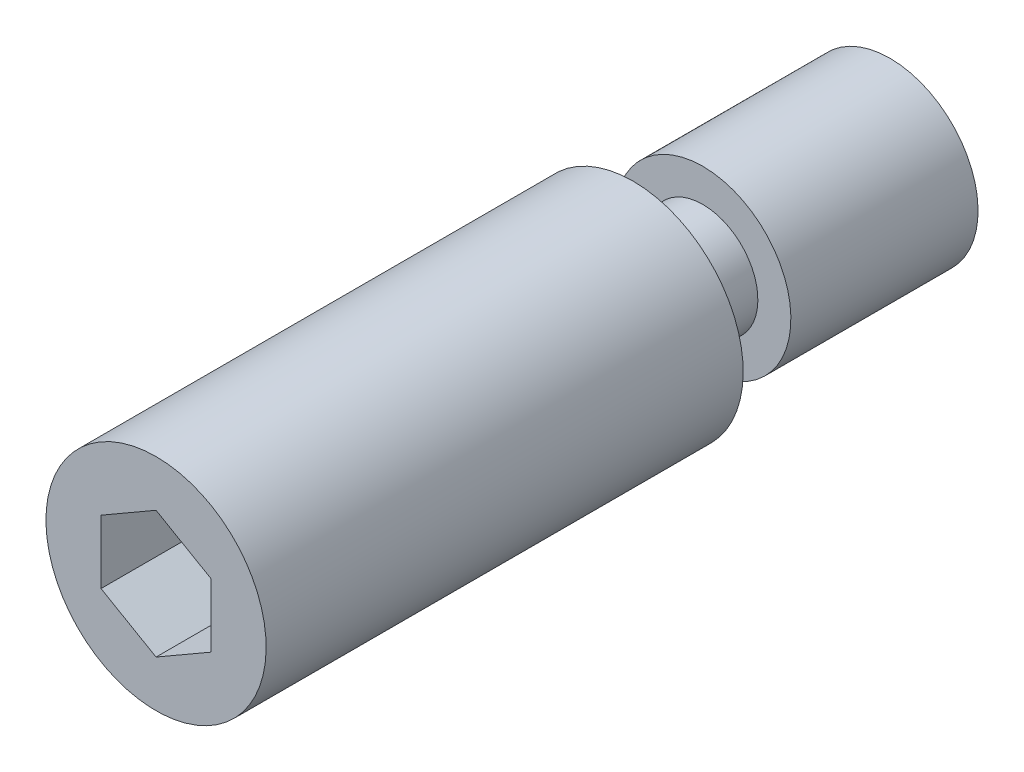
ISO-10303-21;
HEADER;
FILE_DESCRIPTION(('STEP AP214'),'2;1');
FILE_NAME('part.step','',(''),(''),'','','');
FILE_SCHEMA(('AUTOMOTIVE_DESIGN { 1 0 10303 214 1 1 1 1 }'));
ENDSEC;
DATA;
#1=APPLICATION_CONTEXT('core data for automotive mechanical design processes');
#2=APPLICATION_PROTOCOL_DEFINITION('international standard','automotive_design',2000,#1);
#3=PRODUCT_CONTEXT('',#1,'mechanical');
#4=PRODUCT('Part','Part','',(#3));
#5=PRODUCT_RELATED_PRODUCT_CATEGORY('part','',(#4));
#6=PRODUCT_DEFINITION_FORMATION('','',#4);
#7=PRODUCT_DEFINITION_CONTEXT('part definition',#1,'design');
#8=PRODUCT_DEFINITION('design','',#6,#7);
#9=PRODUCT_DEFINITION_SHAPE('','',#8);
#10=(LENGTH_UNIT() NAMED_UNIT(*) SI_UNIT(.MILLI.,.METRE.));
#11=(NAMED_UNIT(*) PLANE_ANGLE_UNIT() SI_UNIT($,.RADIAN.));
#12=(NAMED_UNIT(*) SI_UNIT($,.STERADIAN.) SOLID_ANGLE_UNIT());
#13=UNCERTAINTY_MEASURE_WITH_UNIT(LENGTH_MEASURE(1.E-05),#10,'distance_accuracy_value','');
#14=(GEOMETRIC_REPRESENTATION_CONTEXT(3) GLOBAL_UNCERTAINTY_ASSIGNED_CONTEXT((#13)) GLOBAL_UNIT_ASSIGNED_CONTEXT((#10,
#11,#12)) REPRESENTATION_CONTEXT('',''));
#15=CARTESIAN_POINT('',(0.,0.,0.));
#16=DIRECTION('',(0.,0.,1.));
#17=DIRECTION('',(1.,0.,0.));
#18=AXIS2_PLACEMENT_3D('',#15,#16,#17);
#19=CARTESIAN_POINT('',(0.,-3.,7.));
#20=DIRECTION('',(0.,0.,-1.));
#21=DIRECTION('',(0.,-1.,0.));
#22=AXIS2_PLACEMENT_3D('',#19,#20,#21);
#23=PLANE('',#22);
#24=CARTESIAN_POINT('',(0.,0.,7.));
#25=DIRECTION('',(0.,0.,1.));
#26=DIRECTION('',(0.,1.,0.));
#27=AXIS2_PLACEMENT_3D('',#24,#25,#26);
#28=CIRCLE('',#27,1.5);
#29=CARTESIAN_POINT('',(0.,1.5,7.));
#30=VERTEX_POINT('',#29);
#31=EDGE_CURVE('E115',#30,#30,#28,.T.);
#32=ORIENTED_EDGE('',*,*,#31,.T.);
#33=EDGE_LOOP('',(#32));
#34=FACE_BOUND('',#33,.T.);
#35=CARTESIAN_POINT('',(0.,0.,7.));
#36=DIRECTION('',(0.,0.,1.));
#37=DIRECTION('',(0.,1.,0.));
#38=AXIS2_PLACEMENT_3D('',#35,#36,#37);
#39=CIRCLE('',#38,3.);
#40=CARTESIAN_POINT('',(0.,3.,7.));
#41=VERTEX_POINT('',#40);
#42=EDGE_CURVE('E9',#41,#41,#39,.T.);
#43=ORIENTED_EDGE('',*,*,#42,.F.);
#44=EDGE_LOOP('',(#43));
#45=FACE_BOUND('',#44,.T.);
#46=ADVANCED_FACE('F14',(#34,#45),#23,.T.);
#47=CARTESIAN_POINT('',(0.,0.,20.));
#48=DIRECTION('',(0.,0.,1.));
#49=DIRECTION('',(0.,1.,0.));
#50=AXIS2_PLACEMENT_3D('',#47,#48,#49);
#51=CYLINDRICAL_SURFACE('',#50,3.);
#52=CARTESIAN_POINT('',(0.,0.,20.));
#53=DIRECTION('',(0.,0.,1.));
#54=DIRECTION('',(0.,1.,0.));
#55=AXIS2_PLACEMENT_3D('',#52,#53,#54);
#56=CIRCLE('',#55,3.);
#57=CARTESIAN_POINT('',(0.,3.,20.));
#58=VERTEX_POINT('',#57);
#59=EDGE_CURVE('E21',#58,#58,#56,.T.);
#60=ORIENTED_EDGE('',*,*,#59,.F.);
#61=EDGE_LOOP('',(#60));
#62=FACE_BOUND('',#61,.T.);
#63=ORIENTED_EDGE('',*,*,#42,.T.);
#64=EDGE_LOOP('',(#63));
#65=FACE_BOUND('',#64,.T.);
#66=ADVANCED_FACE('F136',(#62,#65),#51,.T.);
#67=CARTESIAN_POINT('',(0.,-3.,20.));
#68=DIRECTION('',(0.,0.,-1.));
#69=DIRECTION('',(0.,-1.,0.));
#70=AXIS2_PLACEMENT_3D('',#67,#68,#69);
#71=PLANE('',#70);
#72=DIRECTION('',(-0.866025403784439,-0.5,0.));
#73=VECTOR('',#72,1.);
#74=CARTESIAN_POINT('',(0.,1.73205080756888,20.));
#75=LINE('',#74,#73);
#76=CARTESIAN_POINT('',(0.,1.73205080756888,20.));
#77=VERTEX_POINT('',#76);
#78=CARTESIAN_POINT('',(-1.5,0.866025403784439,20.));
#79=VERTEX_POINT('',#78);
#80=EDGE_CURVE('E102',#77,#79,#75,.T.);
#81=ORIENTED_EDGE('',*,*,#80,.F.);
#82=DIRECTION('',(-0.866025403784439,0.5,0.));
#83=VECTOR('',#82,1.);
#84=CARTESIAN_POINT('',(1.5,0.866025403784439,20.));
#85=LINE('',#84,#83);
#86=CARTESIAN_POINT('',(1.5,0.866025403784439,20.));
#87=VERTEX_POINT('',#86);
#88=EDGE_CURVE('E28',#87,#77,#85,.T.);
#89=ORIENTED_EDGE('',*,*,#88,.F.);
#90=DIRECTION('',(0.,1.,0.));
#91=VECTOR('',#90,1.);
#92=CARTESIAN_POINT('',(1.5,-0.866025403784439,20.));
#93=LINE('',#92,#91);
#94=CARTESIAN_POINT('',(1.5,-0.866025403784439,20.));
#95=VERTEX_POINT('',#94);
#96=EDGE_CURVE('E111',#95,#87,#93,.T.);
#97=ORIENTED_EDGE('',*,*,#96,.F.);
#98=DIRECTION('',(0.866025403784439,0.5,0.));
#99=VECTOR('',#98,1.);
#100=CARTESIAN_POINT('',(0.,-1.73205080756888,20.));
#101=LINE('',#100,#99);
#102=CARTESIAN_POINT('',(0.,-1.73205080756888,20.));
#103=VERTEX_POINT('',#102);
#104=EDGE_CURVE('E109',#103,#95,#101,.T.);
#105=ORIENTED_EDGE('',*,*,#104,.F.);
#106=DIRECTION('',(0.866025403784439,-0.5,0.));
#107=VECTOR('',#106,1.);
#108=CARTESIAN_POINT('',(-1.5,-0.866025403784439,20.));
#109=LINE('',#108,#107);
#110=CARTESIAN_POINT('',(-1.5,-0.866025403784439,20.));
#111=VERTEX_POINT('',#110);
#112=EDGE_CURVE('E76',#111,#103,#109,.T.);
#113=ORIENTED_EDGE('',*,*,#112,.F.);
#114=DIRECTION('',(0.,-1.,0.));
#115=VECTOR('',#114,1.);
#116=CARTESIAN_POINT('',(-1.5,0.866025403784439,20.));
#117=LINE('',#116,#115);
#118=EDGE_CURVE('E105',#79,#111,#117,.T.);
#119=ORIENTED_EDGE('',*,*,#118,.F.);
#120=EDGE_LOOP('',(#81,#89,#97,#105,#113,#119));
#121=FACE_BOUND('',#120,.T.);
#122=ORIENTED_EDGE('',*,*,#59,.T.);
#123=EDGE_LOOP('',(#122));
#124=FACE_BOUND('',#123,.T.);
#125=ADVANCED_FACE('F134',(#121,#124),#71,.F.);
#126=CARTESIAN_POINT('',(0.,-2.4,0.));
#127=DIRECTION('',(0.,0.,-1.));
#128=DIRECTION('',(0.,-1.,0.));
#129=AXIS2_PLACEMENT_3D('',#126,#127,#128);
#130=PLANE('',#129);
#131=CARTESIAN_POINT('',(0.,0.,0.));
#132=DIRECTION('',(0.,0.,1.));
#133=DIRECTION('',(0.,1.,0.));
#134=AXIS2_PLACEMENT_3D('',#131,#132,#133);
#135=CIRCLE('',#134,2.4);
#136=CARTESIAN_POINT('',(0.,2.4,0.));
#137=VERTEX_POINT('',#136);
#138=EDGE_CURVE('E129',#137,#137,#135,.T.);
#139=ORIENTED_EDGE('',*,*,#138,.F.);
#140=EDGE_LOOP('',(#139));
#141=FACE_BOUND('',#140,.T.);
#142=ADVANCED_FACE('F167',(#141),#130,.T.);
#143=CARTESIAN_POINT('',(0.,0.,20.));
#144=DIRECTION('',(0.,0.,1.));
#145=DIRECTION('',(0.,1.,0.));
#146=AXIS2_PLACEMENT_3D('',#143,#144,#145);
#147=CYLINDRICAL_SURFACE('',#146,2.4);
#148=ORIENTED_EDGE('',*,*,#138,.T.);
#149=EDGE_LOOP('',(#148));
#150=FACE_BOUND('',#149,.T.);
#151=CARTESIAN_POINT('',(0.,0.,5.1));
#152=DIRECTION('',(0.,0.,1.));
#153=DIRECTION('',(0.,1.,0.));
#154=AXIS2_PLACEMENT_3D('',#151,#152,#153);
#155=CIRCLE('',#154,2.4);
#156=CARTESIAN_POINT('',(0.,2.4,5.1));
#157=VERTEX_POINT('',#156);
#158=EDGE_CURVE('E126',#157,#157,#155,.T.);
#159=ORIENTED_EDGE('',*,*,#158,.F.);
#160=EDGE_LOOP('',(#159));
#161=FACE_BOUND('',#160,.T.);
#162=ADVANCED_FACE('F160',(#150,#161),#147,.T.);
#163=CARTESIAN_POINT('',(0.,-1.5,5.1));
#164=DIRECTION('',(0.,0.,1.));
#165=DIRECTION('',(0.,1.,0.));
#166=AXIS2_PLACEMENT_3D('',#163,#164,#165);
#167=PLANE('',#166);
#168=ORIENTED_EDGE('',*,*,#158,.T.);
#169=EDGE_LOOP('',(#168));
#170=FACE_BOUND('',#169,.T.);
#171=CARTESIAN_POINT('',(0.,0.,5.1));
#172=DIRECTION('',(0.,0.,1.));
#173=DIRECTION('',(0.,1.,0.));
#174=AXIS2_PLACEMENT_3D('',#171,#172,#173);
#175=CIRCLE('',#174,1.5);
#176=CARTESIAN_POINT('',(0.,1.5,5.1));
#177=VERTEX_POINT('',#176);
#178=EDGE_CURVE('E123',#177,#177,#175,.T.);
#179=ORIENTED_EDGE('',*,*,#178,.F.);
#180=EDGE_LOOP('',(#179));
#181=FACE_BOUND('',#180,.T.);
#182=ADVANCED_FACE('F151',(#170,#181),#167,.T.);
#183=CARTESIAN_POINT('',(0.,0.,20.));
#184=DIRECTION('',(0.,0.,1.));
#185=DIRECTION('',(0.,1.,0.));
#186=AXIS2_PLACEMENT_3D('',#183,#184,#185);
#187=CYLINDRICAL_SURFACE('',#186,1.5);
#188=ORIENTED_EDGE('',*,*,#178,.T.);
#189=EDGE_LOOP('',(#188));
#190=FACE_BOUND('',#189,.T.);
#191=ORIENTED_EDGE('',*,*,#31,.F.);
#192=EDGE_LOOP('',(#191));
#193=FACE_BOUND('',#192,.T.);
#194=ADVANCED_FACE('F148',(#190,#193),#187,.T.);
#195=CARTESIAN_POINT('',(1.5,0.866025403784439,16.));
#196=DIRECTION('',(0.5,0.866025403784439,0.));
#197=DIRECTION('',(-0.866025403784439,0.5,0.));
#198=AXIS2_PLACEMENT_3D('',#195,#196,#197);
#199=PLANE('',#198);
#200=ORIENTED_EDGE('',*,*,#88,.T.);
#201=DIRECTION('',(0.,0.,1.));
#202=VECTOR('',#201,1.);
#203=CARTESIAN_POINT('',(0.,1.73205080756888,16.));
#204=LINE('',#203,#202);
#205=CARTESIAN_POINT('',(0.,1.73205080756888,16.));
#206=VERTEX_POINT('',#205);
#207=EDGE_CURVE('E58',#206,#77,#204,.T.);
#208=ORIENTED_EDGE('',*,*,#207,.F.);
#209=DIRECTION('',(-0.866025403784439,0.5,0.));
#210=VECTOR('',#209,1.);
#211=CARTESIAN_POINT('',(1.5,0.866025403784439,16.));
#212=LINE('',#211,#210);
#213=CARTESIAN_POINT('',(1.5,0.866025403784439,16.));
#214=VERTEX_POINT('',#213);
#215=EDGE_CURVE('E113',#214,#206,#212,.T.);
#216=ORIENTED_EDGE('',*,*,#215,.F.);
#217=DIRECTION('',(0.,0.,1.));
#218=VECTOR('',#217,1.);
#219=CARTESIAN_POINT('',(1.5,0.866025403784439,16.));
#220=LINE('',#219,#218);
#221=EDGE_CURVE('E36',#214,#87,#220,.T.);
#222=ORIENTED_EDGE('',*,*,#221,.T.);
#223=EDGE_LOOP('',(#200,#208,#216,#222));
#224=FACE_BOUND('',#223,.T.);
#225=ADVANCED_FACE('F150',(#224),#199,.F.);
#226=CARTESIAN_POINT('',(1.5,-0.866025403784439,16.));
#227=DIRECTION('',(1.,0.,0.));
#228=DIRECTION('',(0.,0.,-1.));
#229=AXIS2_PLACEMENT_3D('',#226,#227,#228);
#230=PLANE('',#229);
#231=ORIENTED_EDGE('',*,*,#96,.T.);
#232=ORIENTED_EDGE('',*,*,#221,.F.);
#233=DIRECTION('',(0.,1.,0.));
#234=VECTOR('',#233,1.);
#235=CARTESIAN_POINT('',(1.5,-0.866025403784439,16.));
#236=LINE('',#235,#234);
#237=CARTESIAN_POINT('',(1.5,-0.866025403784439,16.));
#238=VERTEX_POINT('',#237);
#239=EDGE_CURVE('E88',#238,#214,#236,.T.);
#240=ORIENTED_EDGE('',*,*,#239,.F.);
#241=DIRECTION('',(0.,0.,1.));
#242=VECTOR('',#241,1.);
#243=CARTESIAN_POINT('',(1.5,-0.866025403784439,16.));
#244=LINE('',#243,#242);
#245=EDGE_CURVE('E80',#238,#95,#244,.T.);
#246=ORIENTED_EDGE('',*,*,#245,.T.);
#247=EDGE_LOOP('',(#231,#232,#240,#246));
#248=FACE_BOUND('',#247,.T.);
#249=ADVANCED_FACE('F158',(#248),#230,.F.);
#250=CARTESIAN_POINT('',(0.,-1.73205080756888,16.));
#251=DIRECTION('',(0.5,-0.866025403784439,0.));
#252=DIRECTION('',(0.866025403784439,0.5,0.));
#253=AXIS2_PLACEMENT_3D('',#250,#251,#252);
#254=PLANE('',#253);
#255=ORIENTED_EDGE('',*,*,#104,.T.);
#256=ORIENTED_EDGE('',*,*,#245,.F.);
#257=DIRECTION('',(0.866025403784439,0.5,0.));
#258=VECTOR('',#257,1.);
#259=CARTESIAN_POINT('',(0.,-1.73205080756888,16.));
#260=LINE('',#259,#258);
#261=CARTESIAN_POINT('',(0.,-1.73205080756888,16.));
#262=VERTEX_POINT('',#261);
#263=EDGE_CURVE('E84',#262,#238,#260,.T.);
#264=ORIENTED_EDGE('',*,*,#263,.F.);
#265=DIRECTION('',(0.,0.,1.));
#266=VECTOR('',#265,1.);
#267=CARTESIAN_POINT('',(0.,-1.73205080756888,16.));
#268=LINE('',#267,#266);
#269=EDGE_CURVE('E69',#262,#103,#268,.T.);
#270=ORIENTED_EDGE('',*,*,#269,.T.);
#271=EDGE_LOOP('',(#255,#256,#264,#270));
#272=FACE_BOUND('',#271,.T.);
#273=ADVANCED_FACE('F85',(#272),#254,.F.);
#274=CARTESIAN_POINT('',(-1.5,-0.866025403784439,16.));
#275=DIRECTION('',(-0.5,-0.866025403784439,0.));
#276=DIRECTION('',(0.866025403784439,-0.5,0.));
#277=AXIS2_PLACEMENT_3D('',#274,#275,#276);
#278=PLANE('',#277);
#279=ORIENTED_EDGE('',*,*,#112,.T.);
#280=ORIENTED_EDGE('',*,*,#269,.F.);
#281=DIRECTION('',(0.866025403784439,-0.5,0.));
#282=VECTOR('',#281,1.);
#283=CARTESIAN_POINT('',(-1.5,-0.866025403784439,16.));
#284=LINE('',#283,#282);
#285=CARTESIAN_POINT('',(-1.5,-0.866025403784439,16.));
#286=VERTEX_POINT('',#285);
#287=EDGE_CURVE('E73',#286,#262,#284,.T.);
#288=ORIENTED_EDGE('',*,*,#287,.F.);
#289=DIRECTION('',(0.,0.,1.));
#290=VECTOR('',#289,1.);
#291=CARTESIAN_POINT('',(-1.5,-0.866025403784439,16.));
#292=LINE('',#291,#290);
#293=EDGE_CURVE('E81',#286,#111,#292,.T.);
#294=ORIENTED_EDGE('',*,*,#293,.T.);
#295=EDGE_LOOP('',(#279,#280,#288,#294));
#296=FACE_BOUND('',#295,.T.);
#297=ADVANCED_FACE('F71',(#296),#278,.F.);
#298=CARTESIAN_POINT('',(-1.5,0.866025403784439,16.));
#299=DIRECTION('',(-1.,0.,0.));
#300=DIRECTION('',(0.,-1.,0.));
#301=AXIS2_PLACEMENT_3D('',#298,#299,#300);
#302=PLANE('',#301);
#303=ORIENTED_EDGE('',*,*,#118,.T.);
#304=ORIENTED_EDGE('',*,*,#293,.F.);
#305=DIRECTION('',(0.,-1.,0.));
#306=VECTOR('',#305,1.);
#307=CARTESIAN_POINT('',(-1.5,0.866025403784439,16.));
#308=LINE('',#307,#306);
#309=CARTESIAN_POINT('',(-1.5,0.866025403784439,16.));
#310=VERTEX_POINT('',#309);
#311=EDGE_CURVE('E94',#310,#286,#308,.T.);
#312=ORIENTED_EDGE('',*,*,#311,.F.);
#313=DIRECTION('',(0.,0.,1.));
#314=VECTOR('',#313,1.);
#315=CARTESIAN_POINT('',(-1.5,0.866025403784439,16.));
#316=LINE('',#315,#314);
#317=EDGE_CURVE('E118',#310,#79,#316,.T.);
#318=ORIENTED_EDGE('',*,*,#317,.T.);
#319=EDGE_LOOP('',(#303,#304,#312,#318));
#320=FACE_BOUND('',#319,.T.);
#321=ADVANCED_FACE('F192',(#320),#302,.F.);
#322=CARTESIAN_POINT('',(0.,1.73205080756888,16.));
#323=DIRECTION('',(-0.5,0.866025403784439,0.));
#324=DIRECTION('',(-0.866025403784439,-0.5,0.));
#325=AXIS2_PLACEMENT_3D('',#322,#323,#324);
#326=PLANE('',#325);
#327=ORIENTED_EDGE('',*,*,#80,.T.);
#328=ORIENTED_EDGE('',*,*,#317,.F.);
#329=DIRECTION('',(-0.866025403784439,-0.5,0.));
#330=VECTOR('',#329,1.);
#331=CARTESIAN_POINT('',(0.,1.73205080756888,16.));
#332=LINE('',#331,#330);
#333=EDGE_CURVE('E96',#206,#310,#332,.T.);
#334=ORIENTED_EDGE('',*,*,#333,.F.);
#335=ORIENTED_EDGE('',*,*,#207,.T.);
#336=EDGE_LOOP('',(#327,#328,#334,#335));
#337=FACE_BOUND('',#336,.T.);
#338=ADVANCED_FACE('F180',(#337),#326,.F.);
#339=CARTESIAN_POINT('',(0.,1.73205080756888,16.));
#340=DIRECTION('',(0.,0.,1.));
#341=DIRECTION('',(1.,0.,0.));
#342=AXIS2_PLACEMENT_3D('',#339,#340,#341);
#343=PLANE('',#342);
#344=ORIENTED_EDGE('',*,*,#215,.T.);
#345=ORIENTED_EDGE('',*,*,#333,.T.);
#346=ORIENTED_EDGE('',*,*,#311,.T.);
#347=ORIENTED_EDGE('',*,*,#287,.T.);
#348=ORIENTED_EDGE('',*,*,#263,.T.);
#349=ORIENTED_EDGE('',*,*,#239,.T.);
#350=EDGE_LOOP('',(#344,#345,#346,#347,#348,#349));
#351=FACE_BOUND('',#350,.T.);
#352=ADVANCED_FACE('F91',(#351),#343,.T.);
#353=CLOSED_SHELL('',(#46,#66,#125,#142,#162,#182,#194,#225,#249,#273,#297,#321,#338,#352));
#354=MANIFOLD_SOLID_BREP('B1',#353);
#355=ADVANCED_BREP_SHAPE_REPRESENTATION('',(#18,#354),#14);
#356=SHAPE_DEFINITION_REPRESENTATION(#9,#355);
ENDSEC;
END-ISO-10303-21;
